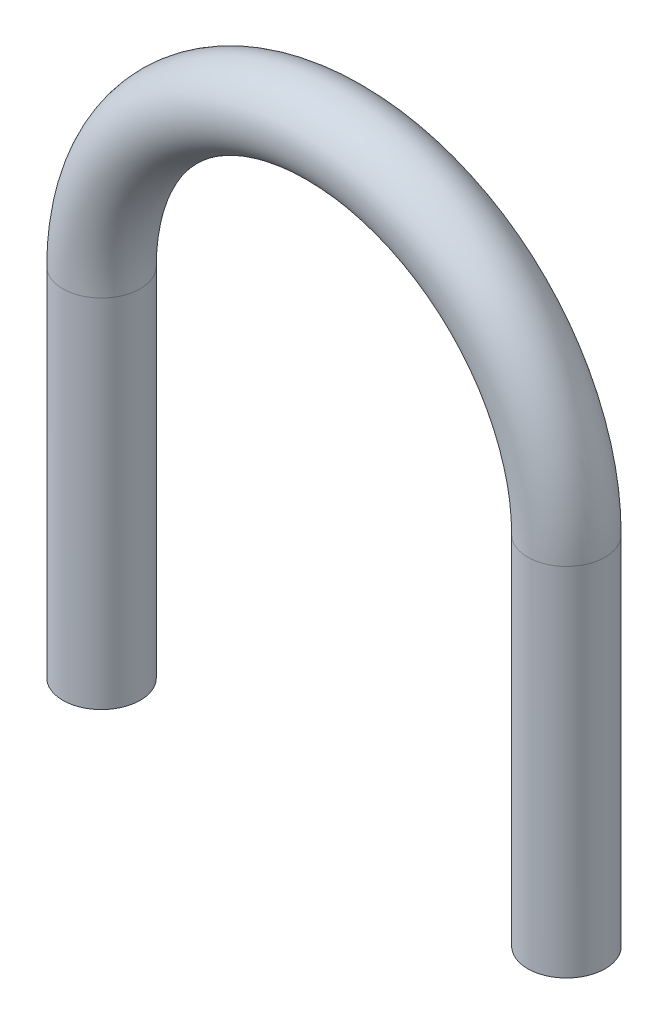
from build123d import *

# Parameters (mm, degrees)
SKETCH2_R = 2.5


with BuildPart() as part:
    # Base-Sweep: sweep along a path in Sketch1
    with BuildLine(Plane.XY) as base_sweep_path:
        Line((15, 0), (15, 23))
        ThreePointArc((15, 23), (0, 38), (-15, 23))
        Line((-15, 23), (-15, 0))
    # Sketch2 → Base-Sweep (sweep)
    with BuildSketch(Plane(origin=(0, 0, 0), x_dir=(1, 0, 0), z_dir=(0, 1, 0))):
        with Locations((15, 0)):
            Circle(SKETCH2_R)
    sweep(path=base_sweep_path.line)


solid = part.part
